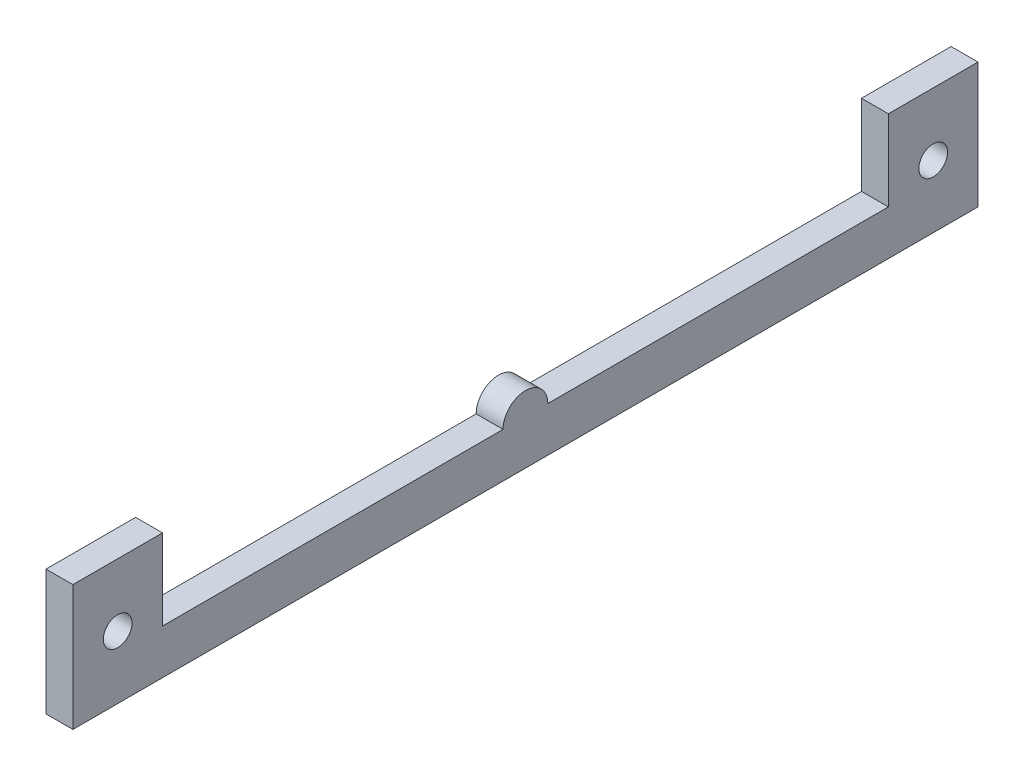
ISO-10303-21;
HEADER;
FILE_DESCRIPTION(('STEP AP214'),'2;1');
FILE_NAME('part.step','',(''),(''),'','','');
FILE_SCHEMA(('AUTOMOTIVE_DESIGN { 1 0 10303 214 1 1 1 1 }'));
ENDSEC;
DATA;
#1=APPLICATION_CONTEXT('core data for automotive mechanical design processes');
#2=APPLICATION_PROTOCOL_DEFINITION('international standard','automotive_design',2000,#1);
#3=PRODUCT_CONTEXT('',#1,'mechanical');
#4=PRODUCT('Part','Part','',(#3));
#5=PRODUCT_RELATED_PRODUCT_CATEGORY('part','',(#4));
#6=PRODUCT_DEFINITION_FORMATION('','',#4);
#7=PRODUCT_DEFINITION_CONTEXT('part definition',#1,'design');
#8=PRODUCT_DEFINITION('design','',#6,#7);
#9=PRODUCT_DEFINITION_SHAPE('','',#8);
#10=(LENGTH_UNIT() NAMED_UNIT(*) SI_UNIT(.MILLI.,.METRE.));
#11=(NAMED_UNIT(*) PLANE_ANGLE_UNIT() SI_UNIT($,.RADIAN.));
#12=(NAMED_UNIT(*) SI_UNIT($,.STERADIAN.) SOLID_ANGLE_UNIT());
#13=UNCERTAINTY_MEASURE_WITH_UNIT(LENGTH_MEASURE(1.E-05),#10,'distance_accuracy_value','');
#14=(GEOMETRIC_REPRESENTATION_CONTEXT(3) GLOBAL_UNCERTAINTY_ASSIGNED_CONTEXT((#13)) GLOBAL_UNIT_ASSIGNED_CONTEXT((#10,
#11,#12)) REPRESENTATION_CONTEXT('',''));
#15=CARTESIAN_POINT('',(0.,0.,0.));
#16=DIRECTION('',(0.,0.,1.));
#17=DIRECTION('',(1.,0.,0.));
#18=AXIS2_PLACEMENT_3D('',#15,#16,#17);
#19=CARTESIAN_POINT('',(-28.5,24.4814087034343,-50.51));
#20=DIRECTION('',(-1.,0.,0.));
#21=DIRECTION('',(0.,0.,1.));
#22=AXIS2_PLACEMENT_3D('',#19,#20,#21);
#23=PLANE('',#22);
#24=CARTESIAN_POINT('',(-28.5,7.,45.5));
#25=DIRECTION('',(-1.,0.,0.));
#26=DIRECTION('',(0.,0.,1.));
#27=AXIS2_PLACEMENT_3D('',#24,#25,#26);
#28=CIRCLE('',#27,1.6);
#29=CARTESIAN_POINT('',(-28.5,7.,47.1));
#30=VERTEX_POINT('',#29);
#31=EDGE_CURVE('E161',#30,#30,#28,.F.);
#32=ORIENTED_EDGE('',*,*,#31,.F.);
#33=EDGE_LOOP('',(#32));
#34=FACE_BOUND('',#33,.T.);
#35=DIRECTION('',(0.,0.,-1.));
#36=VECTOR('',#35,1.);
#37=CARTESIAN_POINT('',(-28.5,0.,0.));
#38=LINE('',#37,#36);
#39=CARTESIAN_POINT('',(-28.5,0.,50.5));
#40=VERTEX_POINT('',#39);
#41=CARTESIAN_POINT('',(-28.5,0.,-50.5));
#42=VERTEX_POINT('',#41);
#43=EDGE_CURVE('E146',#40,#42,#38,.T.);
#44=ORIENTED_EDGE('',*,*,#43,.T.);
#45=DIRECTION('',(0.,-1.,0.));
#46=VECTOR('',#45,1.);
#47=CARTESIAN_POINT('',(-28.5,14.,-50.5));
#48=LINE('',#47,#46);
#49=CARTESIAN_POINT('',(-28.5,14.,-50.5));
#50=VERTEX_POINT('',#49);
#51=EDGE_CURVE('E155',#50,#42,#48,.T.);
#52=ORIENTED_EDGE('',*,*,#51,.F.);
#53=DIRECTION('',(0.,0.,-1.));
#54=VECTOR('',#53,1.);
#55=CARTESIAN_POINT('',(-28.5,14.,0.));
#56=LINE('',#55,#54);
#57=CARTESIAN_POINT('',(-28.5,14.,-40.5));
#58=VERTEX_POINT('',#57);
#59=EDGE_CURVE('E152',#58,#50,#56,.T.);
#60=ORIENTED_EDGE('',*,*,#59,.F.);
#61=DIRECTION('',(0.,-1.,0.));
#62=VECTOR('',#61,1.);
#63=CARTESIAN_POINT('',(-28.5,14.,-40.5));
#64=LINE('',#63,#62);
#65=CARTESIAN_POINT('',(-28.5,5.,-40.5));
#66=VERTEX_POINT('',#65);
#67=EDGE_CURVE('E133',#58,#66,#64,.T.);
#68=ORIENTED_EDGE('',*,*,#67,.T.);
#69=DIRECTION('',(0.,0.,1.));
#70=VECTOR('',#69,1.);
#71=CARTESIAN_POINT('',(-28.5,5.,-40.5));
#72=LINE('',#71,#70);
#73=CARTESIAN_POINT('',(-28.5,5.,-2.5));
#74=VERTEX_POINT('',#73);
#75=EDGE_CURVE('E145',#66,#74,#72,.T.);
#76=ORIENTED_EDGE('',*,*,#75,.T.);
#77=CARTESIAN_POINT('',(-28.5,5.,0.));
#78=DIRECTION('',(-1.,0.,0.));
#79=DIRECTION('',(0.,0.,1.));
#80=AXIS2_PLACEMENT_3D('',#77,#78,#79);
#81=CIRCLE('',#80,2.5);
#82=CARTESIAN_POINT('',(-28.5,5.,2.50000000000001));
#83=VERTEX_POINT('',#82);
#84=EDGE_CURVE('E164',#83,#74,#81,.T.);
#85=ORIENTED_EDGE('',*,*,#84,.F.);
#86=CARTESIAN_POINT('',(-28.5,5.,40.5));
#87=VERTEX_POINT('',#86);
#88=EDGE_CURVE('E138',#83,#87,#72,.T.);
#89=ORIENTED_EDGE('',*,*,#88,.T.);
#90=DIRECTION('',(0.,1.,0.));
#91=VECTOR('',#90,1.);
#92=CARTESIAN_POINT('',(-28.5,14.,40.5));
#93=LINE('',#92,#91);
#94=CARTESIAN_POINT('',(-28.5,14.,40.5));
#95=VERTEX_POINT('',#94);
#96=EDGE_CURVE('E132',#87,#95,#93,.T.);
#97=ORIENTED_EDGE('',*,*,#96,.T.);
#98=CARTESIAN_POINT('',(-28.5,14.,50.5));
#99=VERTEX_POINT('',#98);
#100=EDGE_CURVE('E116',#99,#95,#56,.T.);
#101=ORIENTED_EDGE('',*,*,#100,.F.);
#102=DIRECTION('',(0.,1.,0.));
#103=VECTOR('',#102,1.);
#104=CARTESIAN_POINT('',(-28.5,14.,50.5));
#105=LINE('',#104,#103);
#106=EDGE_CURVE('E153',#40,#99,#105,.T.);
#107=ORIENTED_EDGE('',*,*,#106,.F.);
#108=EDGE_LOOP('',(#44,#52,#60,#68,#76,#85,#89,#97,#101,#107));
#109=FACE_BOUND('',#108,.T.);
#110=CARTESIAN_POINT('',(-28.5,7.,-45.5));
#111=DIRECTION('',(-1.,0.,0.));
#112=DIRECTION('',(0.,0.,1.));
#113=AXIS2_PLACEMENT_3D('',#110,#111,#112);
#114=CIRCLE('',#113,1.6);
#115=CARTESIAN_POINT('',(-28.5,7.,-43.9));
#116=VERTEX_POINT('',#115);
#117=EDGE_CURVE('E158',#116,#116,#114,.F.);
#118=ORIENTED_EDGE('',*,*,#117,.F.);
#119=EDGE_LOOP('',(#118));
#120=FACE_BOUND('',#119,.T.);
#121=ADVANCED_FACE('F32',(#34,#109,#120),#23,.F.);
#122=CARTESIAN_POINT('',(-31.5,24.4814087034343,-50.51));
#123=DIRECTION('',(-1.,0.,0.));
#124=DIRECTION('',(0.,0.,1.));
#125=AXIS2_PLACEMENT_3D('',#122,#123,#124);
#126=PLANE('',#125);
#127=DIRECTION('',(0.,1.,0.));
#128=VECTOR('',#127,1.);
#129=CARTESIAN_POINT('',(-31.5,14.,50.5));
#130=LINE('',#129,#128);
#131=CARTESIAN_POINT('',(-31.5,0.,50.5));
#132=VERTEX_POINT('',#131);
#133=CARTESIAN_POINT('',(-31.5,14.,50.5));
#134=VERTEX_POINT('',#133);
#135=EDGE_CURVE('E125',#132,#134,#130,.T.);
#136=ORIENTED_EDGE('',*,*,#135,.T.);
#137=DIRECTION('',(0.,0.,-1.));
#138=VECTOR('',#137,1.);
#139=CARTESIAN_POINT('',(-31.5,14.,0.));
#140=LINE('',#139,#138);
#141=CARTESIAN_POINT('',(-31.5,14.,40.5));
#142=VERTEX_POINT('',#141);
#143=EDGE_CURVE('E113',#134,#142,#140,.T.);
#144=ORIENTED_EDGE('',*,*,#143,.T.);
#145=DIRECTION('',(0.,-1.,0.));
#146=VECTOR('',#145,1.);
#147=CARTESIAN_POINT('',(-31.5,14.,40.5));
#148=LINE('',#147,#146);
#149=CARTESIAN_POINT('',(-31.5,5.,40.5));
#150=VERTEX_POINT('',#149);
#151=EDGE_CURVE('E36',#142,#150,#148,.T.);
#152=ORIENTED_EDGE('',*,*,#151,.T.);
#153=DIRECTION('',(0.,0.,1.));
#154=VECTOR('',#153,1.);
#155=CARTESIAN_POINT('',(-31.5,5.,-40.5));
#156=LINE('',#155,#154);
#157=CARTESIAN_POINT('',(-31.5,5.,2.50000000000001));
#158=VERTEX_POINT('',#157);
#159=EDGE_CURVE('E201',#158,#150,#156,.T.);
#160=ORIENTED_EDGE('',*,*,#159,.F.);
#161=CARTESIAN_POINT('',(-31.5,5.,0.));
#162=DIRECTION('',(1.,0.,0.));
#163=DIRECTION('',(0.,0.,-1.));
#164=AXIS2_PLACEMENT_3D('',#161,#162,#163);
#165=CIRCLE('',#164,2.5);
#166=CARTESIAN_POINT('',(-31.5,5.,-2.5));
#167=VERTEX_POINT('',#166);
#168=EDGE_CURVE('E11',#167,#158,#165,.T.);
#169=ORIENTED_EDGE('',*,*,#168,.F.);
#170=CARTESIAN_POINT('',(-31.5,5.,-40.5));
#171=VERTEX_POINT('',#170);
#172=EDGE_CURVE('E196',#171,#167,#156,.T.);
#173=ORIENTED_EDGE('',*,*,#172,.F.);
#174=DIRECTION('',(0.,-1.,0.));
#175=VECTOR('',#174,1.);
#176=CARTESIAN_POINT('',(-31.5,14.,-40.5));
#177=LINE('',#176,#175);
#178=CARTESIAN_POINT('',(-31.5,14.,-40.5));
#179=VERTEX_POINT('',#178);
#180=EDGE_CURVE('E49',#179,#171,#177,.T.);
#181=ORIENTED_EDGE('',*,*,#180,.F.);
#182=CARTESIAN_POINT('',(-31.5,14.,-50.5));
#183=VERTEX_POINT('',#182);
#184=EDGE_CURVE('E126',#179,#183,#140,.T.);
#185=ORIENTED_EDGE('',*,*,#184,.T.);
#186=DIRECTION('',(0.,-1.,0.));
#187=VECTOR('',#186,1.);
#188=CARTESIAN_POINT('',(-31.5,14.,-50.5));
#189=LINE('',#188,#187);
#190=CARTESIAN_POINT('',(-31.5,0.,-50.5));
#191=VERTEX_POINT('',#190);
#192=EDGE_CURVE('E149',#183,#191,#189,.T.);
#193=ORIENTED_EDGE('',*,*,#192,.T.);
#194=DIRECTION('',(0.,0.,-1.));
#195=VECTOR('',#194,1.);
#196=CARTESIAN_POINT('',(-31.5,0.,0.));
#197=LINE('',#196,#195);
#198=EDGE_CURVE('E157',#132,#191,#197,.T.);
#199=ORIENTED_EDGE('',*,*,#198,.F.);
#200=EDGE_LOOP('',(#136,#144,#152,#160,#169,#173,#181,#185,#193,#199));
#201=FACE_BOUND('',#200,.T.);
#202=CARTESIAN_POINT('',(-31.5,7.,-45.5));
#203=DIRECTION('',(-1.,0.,0.));
#204=DIRECTION('',(0.,0.,1.));
#205=AXIS2_PLACEMENT_3D('',#202,#203,#204);
#206=CIRCLE('',#205,1.6);
#207=CARTESIAN_POINT('',(-31.5,7.,-43.9));
#208=VERTEX_POINT('',#207);
#209=EDGE_CURVE('E150',#208,#208,#206,.F.);
#210=ORIENTED_EDGE('',*,*,#209,.T.);
#211=EDGE_LOOP('',(#210));
#212=FACE_BOUND('',#211,.T.);
#213=CARTESIAN_POINT('',(-31.5,7.,45.5));
#214=DIRECTION('',(-1.,0.,0.));
#215=DIRECTION('',(0.,0.,1.));
#216=AXIS2_PLACEMENT_3D('',#213,#214,#215);
#217=CIRCLE('',#216,1.6);
#218=CARTESIAN_POINT('',(-31.5,7.,47.1));
#219=VERTEX_POINT('',#218);
#220=EDGE_CURVE('E180',#219,#219,#217,.F.);
#221=ORIENTED_EDGE('',*,*,#220,.T.);
#222=EDGE_LOOP('',(#221));
#223=FACE_BOUND('',#222,.T.);
#224=ADVANCED_FACE('F122',(#201,#212,#223),#126,.T.);
#225=CARTESIAN_POINT('',(0.,14.,0.));
#226=DIRECTION('',(0.,-1.,0.));
#227=DIRECTION('',(0.,0.,-1.));
#228=AXIS2_PLACEMENT_3D('',#225,#226,#227);
#229=PLANE('',#228);
#230=ORIENTED_EDGE('',*,*,#184,.F.);
#231=DIRECTION('',(-1.,0.,0.));
#232=VECTOR('',#231,1.);
#233=CARTESIAN_POINT('',(-31.5,14.,-40.5));
#234=LINE('',#233,#232);
#235=EDGE_CURVE('E41',#58,#179,#234,.T.);
#236=ORIENTED_EDGE('',*,*,#235,.F.);
#237=ORIENTED_EDGE('',*,*,#59,.T.);
#238=DIRECTION('',(-1.,0.,0.));
#239=VECTOR('',#238,1.);
#240=CARTESIAN_POINT('',(-34.5,14.,-50.5));
#241=LINE('',#240,#239);
#242=EDGE_CURVE('E166',#50,#183,#241,.T.);
#243=ORIENTED_EDGE('',*,*,#242,.T.);
#244=EDGE_LOOP('',(#230,#236,#237,#243));
#245=FACE_BOUND('',#244,.T.);
#246=ADVANCED_FACE('F234',(#245),#229,.F.);
#247=ORIENTED_EDGE('',*,*,#143,.F.);
#248=DIRECTION('',(1.,0.,0.));
#249=VECTOR('',#248,1.);
#250=CARTESIAN_POINT('',(-34.5,14.,50.5));
#251=LINE('',#250,#249);
#252=EDGE_CURVE('E173',#134,#99,#251,.T.);
#253=ORIENTED_EDGE('',*,*,#252,.T.);
#254=ORIENTED_EDGE('',*,*,#100,.T.);
#255=DIRECTION('',(1.,0.,0.));
#256=VECTOR('',#255,1.);
#257=CARTESIAN_POINT('',(-1.5,14.,40.5));
#258=LINE('',#257,#256);
#259=EDGE_CURVE('E109',#142,#95,#258,.T.);
#260=ORIENTED_EDGE('',*,*,#259,.F.);
#261=EDGE_LOOP('',(#247,#253,#254,#260));
#262=FACE_BOUND('',#261,.T.);
#263=ADVANCED_FACE('F111',(#262),#229,.F.);
#264=CARTESIAN_POINT('',(-31.5,5.,-40.5));
#265=DIRECTION('',(0.,1.,0.));
#266=DIRECTION('',(-1.,0.,0.));
#267=AXIS2_PLACEMENT_3D('',#264,#265,#266);
#268=PLANE('',#267);
#269=ORIENTED_EDGE('',*,*,#88,.F.);
#270=DIRECTION('',(-1.,0.,0.));
#271=VECTOR('',#270,1.);
#272=CARTESIAN_POINT('',(-22.5,5.,2.50000000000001));
#273=LINE('',#272,#271);
#274=EDGE_CURVE('E141',#158,#83,#273,.F.);
#275=ORIENTED_EDGE('',*,*,#274,.F.);
#276=ORIENTED_EDGE('',*,*,#159,.T.);
#277=DIRECTION('',(1.,0.,0.));
#278=VECTOR('',#277,1.);
#279=CARTESIAN_POINT('',(-1.5,5.,40.5));
#280=LINE('',#279,#278);
#281=EDGE_CURVE('E130',#150,#87,#280,.T.);
#282=ORIENTED_EDGE('',*,*,#281,.T.);
#283=EDGE_LOOP('',(#269,#275,#276,#282));
#284=FACE_BOUND('',#283,.T.);
#285=ADVANCED_FACE('F238',(#284),#268,.T.);
#286=CARTESIAN_POINT('',(-1.5,14.,40.5));
#287=DIRECTION('',(0.,0.,-1.));
#288=DIRECTION('',(-1.,0.,0.));
#289=AXIS2_PLACEMENT_3D('',#286,#287,#288);
#290=PLANE('',#289);
#291=ORIENTED_EDGE('',*,*,#96,.F.);
#292=ORIENTED_EDGE('',*,*,#281,.F.);
#293=ORIENTED_EDGE('',*,*,#151,.F.);
#294=ORIENTED_EDGE('',*,*,#259,.T.);
#295=EDGE_LOOP('',(#291,#292,#293,#294));
#296=FACE_BOUND('',#295,.T.);
#297=ADVANCED_FACE('F128',(#296),#290,.T.);
#298=CARTESIAN_POINT('',(-22.5,5.,0.));
#299=DIRECTION('',(-1.,0.,0.));
#300=DIRECTION('',(0.,0.,1.));
#301=AXIS2_PLACEMENT_3D('',#298,#299,#300);
#302=CYLINDRICAL_SURFACE('',#301,2.5);
#303=ORIENTED_EDGE('',*,*,#274,.T.);
#304=ORIENTED_EDGE('',*,*,#84,.T.);
#305=DIRECTION('',(-1.,0.,0.));
#306=VECTOR('',#305,1.);
#307=CARTESIAN_POINT('',(-22.5,5.,-2.5));
#308=LINE('',#307,#306);
#309=EDGE_CURVE('E194',#74,#167,#308,.T.);
#310=ORIENTED_EDGE('',*,*,#309,.T.);
#311=ORIENTED_EDGE('',*,*,#168,.T.);
#312=EDGE_LOOP('',(#303,#304,#310,#311));
#313=FACE_BOUND('',#312,.T.);
#314=ADVANCED_FACE('F247',(#313),#302,.T.);
#315=CARTESIAN_POINT('',(-31.5,14.,-40.5));
#316=DIRECTION('',(0.,0.,1.));
#317=DIRECTION('',(1.,0.,0.));
#318=AXIS2_PLACEMENT_3D('',#315,#316,#317);
#319=PLANE('',#318);
#320=ORIENTED_EDGE('',*,*,#67,.F.);
#321=ORIENTED_EDGE('',*,*,#235,.T.);
#322=ORIENTED_EDGE('',*,*,#180,.T.);
#323=DIRECTION('',(-1.,0.,0.));
#324=VECTOR('',#323,1.);
#325=CARTESIAN_POINT('',(-31.5,5.,-40.5));
#326=LINE('',#325,#324);
#327=EDGE_CURVE('E198',#66,#171,#326,.T.);
#328=ORIENTED_EDGE('',*,*,#327,.F.);
#329=EDGE_LOOP('',(#320,#321,#322,#328));
#330=FACE_BOUND('',#329,.T.);
#331=ADVANCED_FACE('F244',(#330),#319,.T.);
#332=ORIENTED_EDGE('',*,*,#75,.F.);
#333=ORIENTED_EDGE('',*,*,#327,.T.);
#334=ORIENTED_EDGE('',*,*,#172,.T.);
#335=ORIENTED_EDGE('',*,*,#309,.F.);
#336=EDGE_LOOP('',(#332,#333,#334,#335));
#337=FACE_BOUND('',#336,.T.);
#338=ADVANCED_FACE('F195',(#337),#268,.T.);
#339=CARTESIAN_POINT('',(-34.5,14.,-50.5));
#340=DIRECTION('',(0.,0.,1.));
#341=DIRECTION('',(1.,0.,0.));
#342=AXIS2_PLACEMENT_3D('',#339,#340,#341);
#343=PLANE('',#342);
#344=ORIENTED_EDGE('',*,*,#192,.F.);
#345=ORIENTED_EDGE('',*,*,#242,.F.);
#346=ORIENTED_EDGE('',*,*,#51,.T.);
#347=DIRECTION('',(-1.,0.,0.));
#348=VECTOR('',#347,1.);
#349=CARTESIAN_POINT('',(-34.5,0.,-50.5));
#350=LINE('',#349,#348);
#351=EDGE_CURVE('E170',#42,#191,#350,.T.);
#352=ORIENTED_EDGE('',*,*,#351,.T.);
#353=EDGE_LOOP('',(#344,#345,#346,#352));
#354=FACE_BOUND('',#353,.T.);
#355=ADVANCED_FACE('F215',(#354),#343,.F.);
#356=CARTESIAN_POINT('',(-34.5,14.,50.5));
#357=DIRECTION('',(0.,0.,-1.));
#358=DIRECTION('',(-1.,0.,0.));
#359=AXIS2_PLACEMENT_3D('',#356,#357,#358);
#360=PLANE('',#359);
#361=ORIENTED_EDGE('',*,*,#135,.F.);
#362=DIRECTION('',(1.,0.,0.));
#363=VECTOR('',#362,1.);
#364=CARTESIAN_POINT('',(-34.5,0.,50.5));
#365=LINE('',#364,#363);
#366=EDGE_CURVE('E167',#132,#40,#365,.T.);
#367=ORIENTED_EDGE('',*,*,#366,.T.);
#368=ORIENTED_EDGE('',*,*,#106,.T.);
#369=ORIENTED_EDGE('',*,*,#252,.F.);
#370=EDGE_LOOP('',(#361,#367,#368,#369));
#371=FACE_BOUND('',#370,.T.);
#372=ADVANCED_FACE('F218',(#371),#360,.F.);
#373=CARTESIAN_POINT('',(0.,0.,0.));
#374=DIRECTION('',(0.,-1.,0.));
#375=DIRECTION('',(0.,0.,-1.));
#376=AXIS2_PLACEMENT_3D('',#373,#374,#375);
#377=PLANE('',#376);
#378=ORIENTED_EDGE('',*,*,#366,.F.);
#379=ORIENTED_EDGE('',*,*,#198,.T.);
#380=ORIENTED_EDGE('',*,*,#351,.F.);
#381=ORIENTED_EDGE('',*,*,#43,.F.);
#382=EDGE_LOOP('',(#378,#379,#380,#381));
#383=FACE_BOUND('',#382,.T.);
#384=ADVANCED_FACE('F210',(#383),#377,.T.);
#385=CARTESIAN_POINT('',(-34.5,7.,45.5));
#386=DIRECTION('',(1.,0.,0.));
#387=DIRECTION('',(0.,0.,-1.));
#388=AXIS2_PLACEMENT_3D('',#385,#386,#387);
#389=CYLINDRICAL_SURFACE('',#388,1.6);
#390=ORIENTED_EDGE('',*,*,#31,.T.);
#391=EDGE_LOOP('',(#390));
#392=FACE_BOUND('',#391,.T.);
#393=ORIENTED_EDGE('',*,*,#220,.F.);
#394=EDGE_LOOP('',(#393));
#395=FACE_BOUND('',#394,.T.);
#396=ADVANCED_FACE('F225',(#392,#395),#389,.F.);
#397=CARTESIAN_POINT('',(-34.5,7.,-45.5));
#398=DIRECTION('',(1.,0.,0.));
#399=DIRECTION('',(0.,0.,-1.));
#400=AXIS2_PLACEMENT_3D('',#397,#398,#399);
#401=CYLINDRICAL_SURFACE('',#400,1.6);
#402=ORIENTED_EDGE('',*,*,#117,.T.);
#403=EDGE_LOOP('',(#402));
#404=FACE_BOUND('',#403,.T.);
#405=ORIENTED_EDGE('',*,*,#209,.F.);
#406=EDGE_LOOP('',(#405));
#407=FACE_BOUND('',#406,.T.);
#408=ADVANCED_FACE('F34',(#404,#407),#401,.F.);
#409=CLOSED_SHELL('',(#121,#224,#246,#263,#285,#297,#314,#331,#338,#355,#372,#384,#396,#408));
#410=MANIFOLD_SOLID_BREP('B2',#409);
#411=ADVANCED_BREP_SHAPE_REPRESENTATION('',(#18,#410),#14);
#412=SHAPE_DEFINITION_REPRESENTATION(#9,#411);
ENDSEC;
END-ISO-10303-21;
